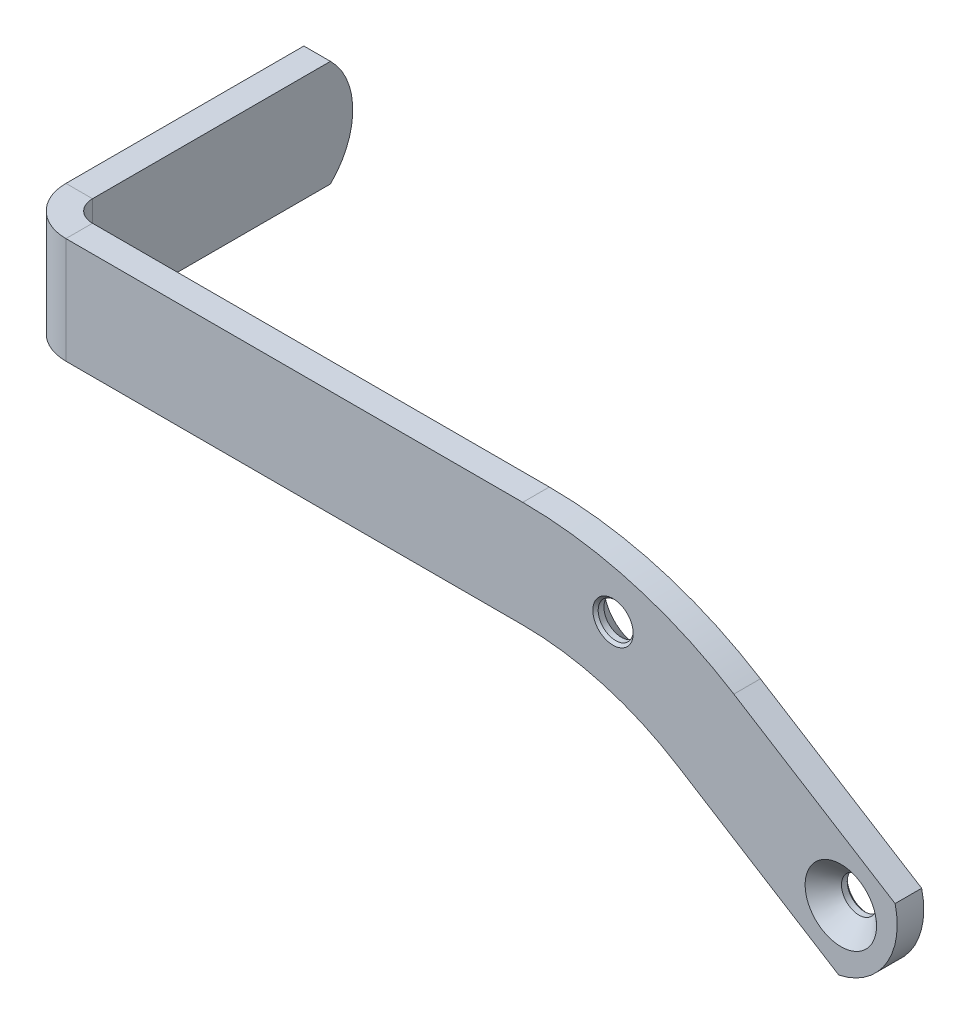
ISO-10303-21;
HEADER;
FILE_DESCRIPTION(('STEP AP214'),'2;1');
FILE_NAME('part.step','',(''),(''),'','','');
FILE_SCHEMA(('AUTOMOTIVE_DESIGN { 1 0 10303 214 1 1 1 1 }'));
ENDSEC;
DATA;
#1=APPLICATION_CONTEXT('core data for automotive mechanical design processes');
#2=APPLICATION_PROTOCOL_DEFINITION('international standard','automotive_design',2000,#1);
#3=PRODUCT_CONTEXT('',#1,'mechanical');
#4=PRODUCT('Part','Part','',(#3));
#5=PRODUCT_RELATED_PRODUCT_CATEGORY('part','',(#4));
#6=PRODUCT_DEFINITION_FORMATION('','',#4);
#7=PRODUCT_DEFINITION_CONTEXT('part definition',#1,'design');
#8=PRODUCT_DEFINITION('design','',#6,#7);
#9=PRODUCT_DEFINITION_SHAPE('','',#8);
#10=(LENGTH_UNIT() NAMED_UNIT(*) SI_UNIT(.MILLI.,.METRE.));
#11=(NAMED_UNIT(*) PLANE_ANGLE_UNIT() SI_UNIT($,.RADIAN.));
#12=(NAMED_UNIT(*) SI_UNIT($,.STERADIAN.) SOLID_ANGLE_UNIT());
#13=UNCERTAINTY_MEASURE_WITH_UNIT(LENGTH_MEASURE(1.E-05),#10,'distance_accuracy_value','');
#14=(GEOMETRIC_REPRESENTATION_CONTEXT(3) GLOBAL_UNCERTAINTY_ASSIGNED_CONTEXT((#13)) GLOBAL_UNIT_ASSIGNED_CONTEXT((#10,
#11,#12)) REPRESENTATION_CONTEXT('',''));
#15=CARTESIAN_POINT('',(0.,0.,0.));
#16=DIRECTION('',(0.,0.,1.));
#17=DIRECTION('',(1.,0.,0.));
#18=AXIS2_PLACEMENT_3D('',#15,#16,#17);
#19=CARTESIAN_POINT('',(-4.99999999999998,0.,0.));
#20=DIRECTION('',(-1.,0.,0.));
#21=DIRECTION('',(0.,0.,1.));
#22=AXIS2_PLACEMENT_3D('',#19,#20,#21);
#23=PLANE('',#22);
#24=CARTESIAN_POINT('',(-4.99999999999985,0.,-43.9999999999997));
#25=DIRECTION('',(-1.,0.,0.));
#26=DIRECTION('',(0.,0.,1.));
#27=AXIS2_PLACEMENT_3D('',#24,#25,#26);
#28=CIRCLE('',#27,14.);
#29=CARTESIAN_POINT('',(-5.00000000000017,10.,-53.7979589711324));
#30=VERTEX_POINT('',#29);
#31=CARTESIAN_POINT('',(-5.00000000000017,-9.99999999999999,-53.7979589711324));
#32=VERTEX_POINT('',#31);
#33=EDGE_CURVE('E129',#30,#32,#28,.T.);
#34=ORIENTED_EDGE('',*,*,#33,.T.);
#35=DIRECTION('',(0.,0.,-1.));
#36=VECTOR('',#35,1.);
#37=CARTESIAN_POINT('',(-5.00000000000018,-9.99999999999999,-57.9999999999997));
#38=LINE('',#37,#36);
#39=CARTESIAN_POINT('',(-5.00000000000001,-10.,-8.99999999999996));
#40=VERTEX_POINT('',#39);
#41=EDGE_CURVE('E133',#40,#32,#38,.T.);
#42=ORIENTED_EDGE('',*,*,#41,.F.);
#43=DIRECTION('',(0.,1.,0.));
#44=VECTOR('',#43,1.);
#45=CARTESIAN_POINT('',(-5.00000000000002,0.,-8.99999999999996));
#46=LINE('',#45,#44);
#47=CARTESIAN_POINT('',(-5.00000000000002,10.,-8.99999999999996));
#48=VERTEX_POINT('',#47);
#49=EDGE_CURVE('E159',#40,#48,#46,.T.);
#50=ORIENTED_EDGE('',*,*,#49,.T.);
#51=DIRECTION('',(0.,0.,1.));
#52=VECTOR('',#51,1.);
#53=CARTESIAN_POINT('',(-5.,10.,-4.99999999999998));
#54=LINE('',#53,#52);
#55=EDGE_CURVE('E134',#30,#48,#54,.T.);
#56=ORIENTED_EDGE('',*,*,#55,.F.);
#57=EDGE_LOOP('',(#34,#42,#50,#56));
#58=FACE_BOUND('',#57,.T.);
#59=ADVANCED_FACE('F39',(#58),#23,.T.);
#60=CARTESIAN_POINT('',(0.,0.,0.));
#61=DIRECTION('',(-1.,0.,0.));
#62=DIRECTION('',(0.,0.,1.));
#63=AXIS2_PLACEMENT_3D('',#60,#61,#62);
#64=PLANE('',#63);
#65=DIRECTION('',(0.,0.,-1.));
#66=VECTOR('',#65,1.);
#67=CARTESIAN_POINT('',(-1.85048510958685E-13,-9.99999999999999,-57.9999999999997));
#68=LINE('',#67,#66);
#69=CARTESIAN_POINT('',(0.,-10.,-8.99999999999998));
#70=VERTEX_POINT('',#69);
#71=CARTESIAN_POINT('',(-1.70487335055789E-13,-9.99999999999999,-53.7979589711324));
#72=VERTEX_POINT('',#71);
#73=EDGE_CURVE('E156',#70,#72,#68,.T.);
#74=ORIENTED_EDGE('',*,*,#73,.T.);
#75=CARTESIAN_POINT('',(1.53625178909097E-13,0.,-43.9999999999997));
#76=DIRECTION('',(-1.,0.,0.));
#77=DIRECTION('',(0.,0.,1.));
#78=AXIS2_PLACEMENT_3D('',#75,#76,#77);
#79=CIRCLE('',#78,14.);
#80=CARTESIAN_POINT('',(-1.73846610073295E-13,10.,-53.7979589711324));
#81=VERTEX_POINT('',#80);
#82=EDGE_CURVE('E138',#81,#72,#79,.T.);
#83=ORIENTED_EDGE('',*,*,#82,.F.);
#84=DIRECTION('',(0.,0.,1.));
#85=VECTOR('',#84,1.);
#86=CARTESIAN_POINT('',(0.,10.,-5.));
#87=LINE('',#86,#85);
#88=CARTESIAN_POINT('',(0.,10.,-8.99999999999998));
#89=VERTEX_POINT('',#88);
#90=EDGE_CURVE('E152',#81,#89,#87,.T.);
#91=ORIENTED_EDGE('',*,*,#90,.T.);
#92=DIRECTION('',(0.,1.,0.));
#93=VECTOR('',#92,1.);
#94=CARTESIAN_POINT('',(0.,-9.99999999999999,-8.99999999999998));
#95=LINE('',#94,#93);
#96=EDGE_CURVE('E347',#70,#89,#95,.T.);
#97=ORIENTED_EDGE('',*,*,#96,.F.);
#98=EDGE_LOOP('',(#74,#83,#91,#97));
#99=FACE_BOUND('',#98,.T.);
#100=ADVANCED_FACE('F246',(#99),#64,.F.);
#101=CARTESIAN_POINT('',(-5.00000000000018,-9.99999999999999,-57.9999999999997));
#102=DIRECTION('',(0.,-1.,0.));
#103=DIRECTION('',(1.,0.,0.));
#104=AXIS2_PLACEMENT_3D('',#101,#102,#103);
#105=PLANE('',#104);
#106=ORIENTED_EDGE('',*,*,#41,.T.);
#107=DIRECTION('',(-1.,0.,0.));
#108=VECTOR('',#107,1.);
#109=CARTESIAN_POINT('',(-5.00000000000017,-9.99999999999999,-53.7979589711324));
#110=LINE('',#109,#108);
#111=EDGE_CURVE('E141',#32,#72,#110,.F.);
#112=ORIENTED_EDGE('',*,*,#111,.T.);
#113=ORIENTED_EDGE('',*,*,#73,.F.);
#114=DIRECTION('',(-1.,0.,0.));
#115=VECTOR('',#114,1.);
#116=CARTESIAN_POINT('',(0.,-9.99999999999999,-8.99999999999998));
#117=LINE('',#116,#115);
#118=EDGE_CURVE('E151',#70,#40,#117,.T.);
#119=ORIENTED_EDGE('',*,*,#118,.T.);
#120=EDGE_LOOP('',(#106,#112,#113,#119));
#121=FACE_BOUND('',#120,.T.);
#122=ADVANCED_FACE('F150',(#121),#105,.T.);
#123=CARTESIAN_POINT('',(-5.,10.,-4.99999999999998));
#124=DIRECTION('',(0.,1.,0.));
#125=DIRECTION('',(-1.,0.,0.));
#126=AXIS2_PLACEMENT_3D('',#123,#124,#125);
#127=PLANE('',#126);
#128=ORIENTED_EDGE('',*,*,#90,.F.);
#129=DIRECTION('',(1.,0.,0.));
#130=VECTOR('',#129,1.);
#131=CARTESIAN_POINT('',(-1.73846610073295E-13,10.,-53.7979589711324));
#132=LINE('',#131,#130);
#133=EDGE_CURVE('E137',#81,#30,#132,.F.);
#134=ORIENTED_EDGE('',*,*,#133,.T.);
#135=ORIENTED_EDGE('',*,*,#55,.T.);
#136=DIRECTION('',(-1.,0.,0.));
#137=VECTOR('',#136,1.);
#138=CARTESIAN_POINT('',(0.,10.,-8.99999999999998));
#139=LINE('',#138,#137);
#140=EDGE_CURVE('E350',#89,#48,#139,.T.);
#141=ORIENTED_EDGE('',*,*,#140,.F.);
#142=EDGE_LOOP('',(#128,#134,#135,#141));
#143=FACE_BOUND('',#142,.T.);
#144=ADVANCED_FACE('F257',(#143),#127,.T.);
#145=CARTESIAN_POINT('',(90.,-65.,-5.));
#146=DIRECTION('',(0.,0.,-1.));
#147=DIRECTION('',(-1.,0.,0.));
#148=AXIS2_PLACEMENT_3D('',#145,#146,#147);
#149=PLANE('',#148);
#150=CARTESIAN_POINT('',(107.,-0.999999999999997,-5.));
#151=DIRECTION('',(0.,0.,-1.));
#152=DIRECTION('',(-1.,0.,0.));
#153=AXIS2_PLACEMENT_3D('',#150,#151,#152);
#154=CIRCLE('',#153,6.72);
#155=CARTESIAN_POINT('',(100.28,-0.999999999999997,-5.));
#156=VERTEX_POINT('',#155);
#157=EDGE_CURVE('E559',#156,#156,#154,.T.);
#158=ORIENTED_EDGE('',*,*,#157,.F.);
#159=EDGE_LOOP('',(#158));
#160=FACE_BOUND('',#159,.T.);
#161=CARTESIAN_POINT('',(149.886195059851,-25.7744516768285,-5.));
#162=DIRECTION('',(0.,0.,-1.));
#163=DIRECTION('',(-1.,0.,0.));
#164=AXIS2_PLACEMENT_3D('',#161,#162,#163);
#165=CIRCLE('',#164,3.80000000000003);
#166=CARTESIAN_POINT('',(146.086195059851,-25.7744516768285,-5.));
#167=VERTEX_POINT('',#166);
#168=EDGE_CURVE('E227',#167,#167,#165,.F.);
#169=ORIENTED_EDGE('',*,*,#168,.T.);
#170=EDGE_LOOP('',(#169));
#171=FACE_BOUND('',#170,.T.);
#172=DIRECTION('',(-0.848048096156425,0.529919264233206,0.));
#173=VECTOR('',#172,1.);
#174=CARTESIAN_POINT('',(129.74394481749,-1.39639278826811,-5.));
#175=LINE('',#174,#173);
#176=CARTESIAN_POINT('',(160.102335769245,-20.3664208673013,-5.));
#177=VERTEX_POINT('',#176);
#178=CARTESIAN_POINT('',(129.74394481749,-1.3963927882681,-5.));
#179=VERTEX_POINT('',#178);
#180=EDGE_CURVE('E192',#177,#179,#175,.T.);
#181=ORIENTED_EDGE('',*,*,#180,.F.);
#182=CARTESIAN_POINT('',(146.494002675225,-23.6547746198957,-5.));
#183=DIRECTION('',(0.,0.,-1.));
#184=DIRECTION('',(-1.,0.,0.));
#185=AXIS2_PLACEMENT_3D('',#182,#183,#184);
#186=CIRCLE('',#185,14.);
#187=CARTESIAN_POINT('',(149.503950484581,-37.3273827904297,-5.));
#188=VERTEX_POINT('',#187);
#189=EDGE_CURVE('E341',#177,#188,#186,.T.);
#190=ORIENTED_EDGE('',*,*,#189,.T.);
#191=DIRECTION('',(0.848048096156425,-0.529919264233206,0.));
#192=VECTOR('',#191,1.);
#193=CARTESIAN_POINT('',(153.067483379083,-39.5541252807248,-5.));
#194=LINE('',#193,#192);
#195=CARTESIAN_POINT('',(119.145559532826,-18.3573547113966,-5.));
#196=VERTEX_POINT('',#195);
#197=EDGE_CURVE('E189',#196,#188,#194,.T.);
#198=ORIENTED_EDGE('',*,*,#197,.F.);
#199=CARTESIAN_POINT('',(90.,-65.,-5.));
#200=DIRECTION('',(0.,0.,-1.));
#201=DIRECTION('',(1.,0.,0.));
#202=AXIS2_PLACEMENT_3D('',#199,#200,#201);
#203=CIRCLE('',#202,55.);
#204=CARTESIAN_POINT('',(90.,-9.99999999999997,-5.));
#205=VERTEX_POINT('',#204);
#206=EDGE_CURVE('E185',#205,#196,#203,.T.);
#207=ORIENTED_EDGE('',*,*,#206,.F.);
#208=DIRECTION('',(1.,0.,0.));
#209=VECTOR('',#208,1.);
#210=CARTESIAN_POINT('',(90.,-9.99999999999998,-5.));
#211=LINE('',#210,#209);
#212=CARTESIAN_POINT('',(4.,-10.,-5.));
#213=VERTEX_POINT('',#212);
#214=EDGE_CURVE('E183',#213,#205,#211,.T.);
#215=ORIENTED_EDGE('',*,*,#214,.F.);
#216=DIRECTION('',(0.,1.,0.));
#217=VECTOR('',#216,1.);
#218=CARTESIAN_POINT('',(3.99999999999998,10.,-5.));
#219=LINE('',#218,#217);
#220=CARTESIAN_POINT('',(3.99999999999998,10.,-5.));
#221=VERTEX_POINT('',#220);
#222=EDGE_CURVE('E175',#221,#213,#219,.F.);
#223=ORIENTED_EDGE('',*,*,#222,.F.);
#224=DIRECTION('',(-1.,0.,0.));
#225=VECTOR('',#224,1.);
#226=CARTESIAN_POINT('',(0.,10.,-5.));
#227=LINE('',#226,#225);
#228=CARTESIAN_POINT('',(90.,10.,-5.));
#229=VERTEX_POINT('',#228);
#230=EDGE_CURVE('E197',#229,#221,#227,.T.);
#231=ORIENTED_EDGE('',*,*,#230,.F.);
#232=CARTESIAN_POINT('',(90.,-65.,-5.));
#233=DIRECTION('',(0.,0.,1.));
#234=DIRECTION('',(-1.,0.,0.));
#235=AXIS2_PLACEMENT_3D('',#232,#233,#234);
#236=CIRCLE('',#235,75.);
#237=EDGE_CURVE('E194',#179,#229,#236,.T.);
#238=ORIENTED_EDGE('',*,*,#237,.F.);
#239=EDGE_LOOP('',(#181,#190,#198,#207,#215,#223,#231,#238));
#240=FACE_BOUND('',#239,.T.);
#241=ADVANCED_FACE('F260',(#160,#171,#240),#149,.T.);
#242=CARTESIAN_POINT('',(90.,-65.,0.));
#243=DIRECTION('',(0.,0.,-1.));
#244=DIRECTION('',(-1.,0.,0.));
#245=AXIS2_PLACEMENT_3D('',#242,#243,#244);
#246=PLANE('',#245);
#247=CARTESIAN_POINT('',(107.,-0.999999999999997,0.));
#248=DIRECTION('',(0.,0.,-1.));
#249=DIRECTION('',(-1.,0.,0.));
#250=AXIS2_PLACEMENT_3D('',#247,#248,#249);
#251=CIRCLE('',#250,3.79999999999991);
#252=CARTESIAN_POINT('',(103.2,-0.999999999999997,0.));
#253=VERTEX_POINT('',#252);
#254=EDGE_CURVE('E47',#253,#253,#251,.T.);
#255=ORIENTED_EDGE('',*,*,#254,.T.);
#256=EDGE_LOOP('',(#255));
#257=FACE_BOUND('',#256,.T.);
#258=CARTESIAN_POINT('',(149.886195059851,-25.7744516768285,0.));
#259=DIRECTION('',(0.,0.,1.));
#260=DIRECTION('',(1.,0.,0.));
#261=AXIS2_PLACEMENT_3D('',#258,#259,#260);
#262=CIRCLE('',#261,6.72);
#263=CARTESIAN_POINT('',(156.606195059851,-25.7744516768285,0.));
#264=VERTEX_POINT('',#263);
#265=EDGE_CURVE('E329',#264,#264,#262,.T.);
#266=ORIENTED_EDGE('',*,*,#265,.F.);
#267=EDGE_LOOP('',(#266));
#268=FACE_BOUND('',#267,.T.);
#269=CARTESIAN_POINT('',(146.494002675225,-23.6547746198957,0.));
#270=DIRECTION('',(0.,0.,-1.));
#271=DIRECTION('',(-1.,0.,0.));
#272=AXIS2_PLACEMENT_3D('',#269,#270,#271);
#273=CIRCLE('',#272,14.);
#274=CARTESIAN_POINT('',(160.102335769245,-20.3664208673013,0.));
#275=VERTEX_POINT('',#274);
#276=CARTESIAN_POINT('',(149.503950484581,-37.3273827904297,0.));
#277=VERTEX_POINT('',#276);
#278=EDGE_CURVE('E54',#275,#277,#273,.T.);
#279=ORIENTED_EDGE('',*,*,#278,.F.);
#280=DIRECTION('',(-0.848048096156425,0.529919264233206,0.));
#281=VECTOR('',#280,1.);
#282=CARTESIAN_POINT('',(129.74394481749,-1.39639278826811,0.));
#283=LINE('',#282,#281);
#284=CARTESIAN_POINT('',(129.74394481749,-1.3963927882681,0.));
#285=VERTEX_POINT('',#284);
#286=EDGE_CURVE('E208',#275,#285,#283,.T.);
#287=ORIENTED_EDGE('',*,*,#286,.T.);
#288=CARTESIAN_POINT('',(90.,-65.,0.));
#289=DIRECTION('',(0.,0.,1.));
#290=DIRECTION('',(-1.,0.,0.));
#291=AXIS2_PLACEMENT_3D('',#288,#289,#290);
#292=CIRCLE('',#291,75.);
#293=CARTESIAN_POINT('',(90.,10.,0.));
#294=VERTEX_POINT('',#293);
#295=EDGE_CURVE('E210',#285,#294,#292,.T.);
#296=ORIENTED_EDGE('',*,*,#295,.T.);
#297=DIRECTION('',(-1.,0.,0.));
#298=VECTOR('',#297,1.);
#299=CARTESIAN_POINT('',(0.,10.,0.));
#300=LINE('',#299,#298);
#301=CARTESIAN_POINT('',(3.99999999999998,10.,0.));
#302=VERTEX_POINT('',#301);
#303=EDGE_CURVE('E186',#294,#302,#300,.T.);
#304=ORIENTED_EDGE('',*,*,#303,.T.);
#305=DIRECTION('',(0.,1.,0.));
#306=VECTOR('',#305,1.);
#307=CARTESIAN_POINT('',(3.99999999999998,10.,0.));
#308=LINE('',#307,#306);
#309=CARTESIAN_POINT('',(4.,-10.,0.));
#310=VERTEX_POINT('',#309);
#311=EDGE_CURVE('E163',#302,#310,#308,.F.);
#312=ORIENTED_EDGE('',*,*,#311,.T.);
#313=DIRECTION('',(1.,0.,0.));
#314=VECTOR('',#313,1.);
#315=CARTESIAN_POINT('',(90.,-9.99999999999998,0.));
#316=LINE('',#315,#314);
#317=CARTESIAN_POINT('',(90.,-9.99999999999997,0.));
#318=VERTEX_POINT('',#317);
#319=EDGE_CURVE('E181',#310,#318,#316,.T.);
#320=ORIENTED_EDGE('',*,*,#319,.T.);
#321=CARTESIAN_POINT('',(90.,-65.,0.));
#322=DIRECTION('',(0.,0.,-1.));
#323=DIRECTION('',(1.,0.,0.));
#324=AXIS2_PLACEMENT_3D('',#321,#322,#323);
#325=CIRCLE('',#324,55.);
#326=CARTESIAN_POINT('',(119.145559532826,-18.3573547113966,0.));
#327=VERTEX_POINT('',#326);
#328=EDGE_CURVE('E202',#318,#327,#325,.T.);
#329=ORIENTED_EDGE('',*,*,#328,.T.);
#330=DIRECTION('',(0.848048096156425,-0.529919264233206,0.));
#331=VECTOR('',#330,1.);
#332=CARTESIAN_POINT('',(153.067483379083,-39.5541252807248,0.));
#333=LINE('',#332,#331);
#334=EDGE_CURVE('E205',#327,#277,#333,.T.);
#335=ORIENTED_EDGE('',*,*,#334,.T.);
#336=EDGE_LOOP('',(#279,#287,#296,#304,#312,#320,#329,#335));
#337=FACE_BOUND('',#336,.T.);
#338=ADVANCED_FACE('F232',(#257,#268,#337),#246,.F.);
#339=CARTESIAN_POINT('',(129.74394481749,-1.39639278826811,-5.));
#340=DIRECTION('',(0.529919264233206,0.848048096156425,0.));
#341=DIRECTION('',(-0.848048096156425,0.529919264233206,0.));
#342=AXIS2_PLACEMENT_3D('',#339,#340,#341);
#343=PLANE('',#342);
#344=ORIENTED_EDGE('',*,*,#286,.F.);
#345=DIRECTION('',(0.,0.,1.));
#346=VECTOR('',#345,1.);
#347=CARTESIAN_POINT('',(160.102335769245,-20.3664208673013,0.));
#348=LINE('',#347,#346);
#349=EDGE_CURVE('E338',#275,#177,#348,.F.);
#350=ORIENTED_EDGE('',*,*,#349,.T.);
#351=ORIENTED_EDGE('',*,*,#180,.T.);
#352=DIRECTION('',(0.,0.,1.));
#353=VECTOR('',#352,1.);
#354=CARTESIAN_POINT('',(129.74394481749,-1.3963927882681,-5.));
#355=LINE('',#354,#353);
#356=EDGE_CURVE('E218',#179,#285,#355,.T.);
#357=ORIENTED_EDGE('',*,*,#356,.T.);
#358=EDGE_LOOP('',(#344,#350,#351,#357));
#359=FACE_BOUND('',#358,.T.);
#360=ADVANCED_FACE('F286',(#359),#343,.T.);
#361=CARTESIAN_POINT('',(153.067483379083,-39.5541252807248,-5.));
#362=DIRECTION('',(-0.529919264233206,-0.848048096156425,0.));
#363=DIRECTION('',(0.848048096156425,-0.529919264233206,0.));
#364=AXIS2_PLACEMENT_3D('',#361,#362,#363);
#365=PLANE('',#364);
#366=ORIENTED_EDGE('',*,*,#197,.T.);
#367=DIRECTION('',(0.,0.,-1.));
#368=VECTOR('',#367,1.);
#369=CARTESIAN_POINT('',(149.503950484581,-37.3273827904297,-5.));
#370=LINE('',#369,#368);
#371=EDGE_CURVE('E343',#188,#277,#370,.F.);
#372=ORIENTED_EDGE('',*,*,#371,.T.);
#373=ORIENTED_EDGE('',*,*,#334,.F.);
#374=DIRECTION('',(0.,0.,1.));
#375=VECTOR('',#374,1.);
#376=CARTESIAN_POINT('',(119.145559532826,-18.3573547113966,-5.));
#377=LINE('',#376,#375);
#378=EDGE_CURVE('E221',#196,#327,#377,.T.);
#379=ORIENTED_EDGE('',*,*,#378,.F.);
#380=EDGE_LOOP('',(#366,#372,#373,#379));
#381=FACE_BOUND('',#380,.T.);
#382=ADVANCED_FACE('F291',(#381),#365,.T.);
#383=CARTESIAN_POINT('',(0.,10.,-5.));
#384=DIRECTION('',(0.,1.,0.));
#385=DIRECTION('',(0.,0.,1.));
#386=AXIS2_PLACEMENT_3D('',#383,#384,#385);
#387=PLANE('',#386);
#388=ORIENTED_EDGE('',*,*,#230,.T.);
#389=DIRECTION('',(0.,0.,1.));
#390=VECTOR('',#389,1.);
#391=CARTESIAN_POINT('',(3.99999999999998,10.,-5.));
#392=LINE('',#391,#390);
#393=EDGE_CURVE('E169',#221,#302,#392,.T.);
#394=ORIENTED_EDGE('',*,*,#393,.T.);
#395=ORIENTED_EDGE('',*,*,#303,.F.);
#396=DIRECTION('',(0.,0.,1.));
#397=VECTOR('',#396,1.);
#398=CARTESIAN_POINT('',(90.,10.,-5.));
#399=LINE('',#398,#397);
#400=EDGE_CURVE('E215',#229,#294,#399,.T.);
#401=ORIENTED_EDGE('',*,*,#400,.F.);
#402=EDGE_LOOP('',(#388,#394,#395,#401));
#403=FACE_BOUND('',#402,.T.);
#404=ADVANCED_FACE('F287',(#403),#387,.T.);
#405=CARTESIAN_POINT('',(90.,-65.,-5.));
#406=DIRECTION('',(0.,0.,1.));
#407=DIRECTION('',(1.,0.,0.));
#408=AXIS2_PLACEMENT_3D('',#405,#406,#407);
#409=CYLINDRICAL_SURFACE('',#408,75.);
#410=ORIENTED_EDGE('',*,*,#295,.F.);
#411=ORIENTED_EDGE('',*,*,#356,.F.);
#412=ORIENTED_EDGE('',*,*,#237,.T.);
#413=ORIENTED_EDGE('',*,*,#400,.T.);
#414=EDGE_LOOP('',(#410,#411,#412,#413));
#415=FACE_BOUND('',#414,.T.);
#416=ADVANCED_FACE('F290',(#415),#409,.T.);
#417=CARTESIAN_POINT('',(90.,-65.,-5.));
#418=DIRECTION('',(0.,0.,1.));
#419=DIRECTION('',(1.,0.,0.));
#420=AXIS2_PLACEMENT_3D('',#417,#418,#419);
#421=CYLINDRICAL_SURFACE('',#420,55.);
#422=ORIENTED_EDGE('',*,*,#328,.F.);
#423=DIRECTION('',(0.,0.,1.));
#424=VECTOR('',#423,1.);
#425=CARTESIAN_POINT('',(90.,-9.99999999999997,-5.));
#426=LINE('',#425,#424);
#427=EDGE_CURVE('E200',#205,#318,#426,.T.);
#428=ORIENTED_EDGE('',*,*,#427,.F.);
#429=ORIENTED_EDGE('',*,*,#206,.T.);
#430=ORIENTED_EDGE('',*,*,#378,.T.);
#431=EDGE_LOOP('',(#422,#428,#429,#430));
#432=FACE_BOUND('',#431,.T.);
#433=ADVANCED_FACE('F295',(#432),#421,.F.);
#434=CARTESIAN_POINT('',(90.,-9.99999999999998,-5.));
#435=DIRECTION('',(0.,-1.,0.));
#436=DIRECTION('',(1.,0.,0.));
#437=AXIS2_PLACEMENT_3D('',#434,#435,#436);
#438=PLANE('',#437);
#439=DIRECTION('',(0.,0.,1.));
#440=VECTOR('',#439,1.);
#441=CARTESIAN_POINT('',(3.99999999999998,-10.,-5.));
#442=LINE('',#441,#440);
#443=EDGE_CURVE('E62',#213,#310,#442,.T.);
#444=ORIENTED_EDGE('',*,*,#443,.F.);
#445=ORIENTED_EDGE('',*,*,#214,.T.);
#446=ORIENTED_EDGE('',*,*,#427,.T.);
#447=ORIENTED_EDGE('',*,*,#319,.F.);
#448=EDGE_LOOP('',(#444,#445,#446,#447));
#449=FACE_BOUND('',#448,.T.);
#450=ADVANCED_FACE('F276',(#449),#438,.T.);
#451=CARTESIAN_POINT('',(3.99999999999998,-10.,-8.99999999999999));
#452=DIRECTION('',(0.,-1.,0.));
#453=DIRECTION('',(1.,0.,0.));
#454=AXIS2_PLACEMENT_3D('',#451,#452,#453);
#455=PLANE('',#454);
#456=ORIENTED_EDGE('',*,*,#118,.F.);
#457=CARTESIAN_POINT('',(3.99999999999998,-10.,-8.99999999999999));
#458=DIRECTION('',(0.,1.,0.));
#459=DIRECTION('',(-1.,0.,0.));
#460=AXIS2_PLACEMENT_3D('',#457,#458,#459);
#461=CIRCLE('',#460,3.99999999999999);
#462=EDGE_CURVE('E172',#213,#70,#461,.F.);
#463=ORIENTED_EDGE('',*,*,#462,.F.);
#464=ORIENTED_EDGE('',*,*,#443,.T.);
#465=CARTESIAN_POINT('',(3.99999999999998,-10.,-8.99999999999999));
#466=DIRECTION('',(0.,1.,0.));
#467=DIRECTION('',(-1.,0.,0.));
#468=AXIS2_PLACEMENT_3D('',#465,#466,#467);
#469=CIRCLE('',#468,8.99999999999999);
#470=EDGE_CURVE('E165',#310,#40,#469,.F.);
#471=ORIENTED_EDGE('',*,*,#470,.T.);
#472=EDGE_LOOP('',(#456,#463,#464,#471));
#473=FACE_BOUND('',#472,.T.);
#474=ADVANCED_FACE('F273',(#473),#455,.T.);
#475=CARTESIAN_POINT('',(3.99999999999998,10.,-8.99999999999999));
#476=DIRECTION('',(0.,-1.,0.));
#477=DIRECTION('',(1.,0.,0.));
#478=AXIS2_PLACEMENT_3D('',#475,#476,#477);
#479=PLANE('',#478);
#480=CARTESIAN_POINT('',(3.99999999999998,10.,-8.99999999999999));
#481=DIRECTION('',(0.,1.,0.));
#482=DIRECTION('',(-1.,0.,0.));
#483=AXIS2_PLACEMENT_3D('',#480,#481,#482);
#484=CIRCLE('',#483,3.99999999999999);
#485=EDGE_CURVE('E154',#89,#221,#484,.T.);
#486=ORIENTED_EDGE('',*,*,#485,.F.);
#487=ORIENTED_EDGE('',*,*,#140,.T.);
#488=CARTESIAN_POINT('',(3.99999999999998,10.,-8.99999999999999));
#489=DIRECTION('',(0.,1.,0.));
#490=DIRECTION('',(-1.,0.,0.));
#491=AXIS2_PLACEMENT_3D('',#488,#489,#490);
#492=CIRCLE('',#491,8.99999999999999);
#493=EDGE_CURVE('E166',#48,#302,#492,.T.);
#494=ORIENTED_EDGE('',*,*,#493,.T.);
#495=ORIENTED_EDGE('',*,*,#393,.F.);
#496=EDGE_LOOP('',(#486,#487,#494,#495));
#497=FACE_BOUND('',#496,.T.);
#498=ADVANCED_FACE('F268',(#497),#479,.F.);
#499=CARTESIAN_POINT('',(3.99999999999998,10.,-8.99999999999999));
#500=DIRECTION('',(0.,1.,0.));
#501=DIRECTION('',(-1.,0.,0.));
#502=AXIS2_PLACEMENT_3D('',#499,#500,#501);
#503=CYLINDRICAL_SURFACE('',#502,8.99999999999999);
#504=ORIENTED_EDGE('',*,*,#311,.F.);
#505=ORIENTED_EDGE('',*,*,#493,.F.);
#506=ORIENTED_EDGE('',*,*,#49,.F.);
#507=ORIENTED_EDGE('',*,*,#470,.F.);
#508=EDGE_LOOP('',(#504,#505,#506,#507));
#509=FACE_BOUND('',#508,.T.);
#510=ADVANCED_FACE('F264',(#509),#503,.T.);
#511=CARTESIAN_POINT('',(3.99999999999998,10.,-8.99999999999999));
#512=DIRECTION('',(0.,1.,0.));
#513=DIRECTION('',(-1.,0.,0.));
#514=AXIS2_PLACEMENT_3D('',#511,#512,#513);
#515=CYLINDRICAL_SURFACE('',#514,3.99999999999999);
#516=ORIENTED_EDGE('',*,*,#222,.T.);
#517=ORIENTED_EDGE('',*,*,#462,.T.);
#518=ORIENTED_EDGE('',*,*,#96,.T.);
#519=ORIENTED_EDGE('',*,*,#485,.T.);
#520=EDGE_LOOP('',(#516,#517,#518,#519));
#521=FACE_BOUND('',#520,.T.);
#522=ADVANCED_FACE('F267',(#521),#515,.F.);
#523=CARTESIAN_POINT('',(146.494002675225,-23.6547746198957,-5.));
#524=DIRECTION('',(0.,0.,-1.));
#525=DIRECTION('',(-1.,0.,0.));
#526=AXIS2_PLACEMENT_3D('',#523,#524,#525);
#527=CYLINDRICAL_SURFACE('',#526,14.);
#528=ORIENTED_EDGE('',*,*,#371,.F.);
#529=ORIENTED_EDGE('',*,*,#189,.F.);
#530=ORIENTED_EDGE('',*,*,#349,.F.);
#531=ORIENTED_EDGE('',*,*,#278,.T.);
#532=EDGE_LOOP('',(#528,#529,#530,#531));
#533=FACE_BOUND('',#532,.T.);
#534=ADVANCED_FACE('F254',(#533),#527,.T.);
#535=CARTESIAN_POINT('',(1.53625178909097E-13,0.,-43.9999999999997));
#536=DIRECTION('',(-1.,0.,0.));
#537=DIRECTION('',(0.,0.,1.));
#538=AXIS2_PLACEMENT_3D('',#535,#536,#537);
#539=CYLINDRICAL_SURFACE('',#538,14.);
#540=ORIENTED_EDGE('',*,*,#82,.T.);
#541=ORIENTED_EDGE('',*,*,#111,.F.);
#542=ORIENTED_EDGE('',*,*,#33,.F.);
#543=ORIENTED_EDGE('',*,*,#133,.F.);
#544=EDGE_LOOP('',(#540,#541,#542,#543));
#545=FACE_BOUND('',#544,.T.);
#546=ADVANCED_FACE('F142',(#545),#539,.T.);
#547=CARTESIAN_POINT('',(149.886195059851,-25.7744516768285,0.));
#548=DIRECTION('',(0.,0.,1.));
#549=DIRECTION('',(1.,0.,0.));
#550=AXIS2_PLACEMENT_3D('',#547,#548,#549);
#551=CYLINDRICAL_SURFACE('',#550,3.3);
#552=CARTESIAN_POINT('',(149.886195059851,-25.7744516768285,-4.49999999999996));
#553=DIRECTION('',(0.,0.,-1.));
#554=DIRECTION('',(-1.,0.,0.));
#555=AXIS2_PLACEMENT_3D('',#552,#553,#554);
#556=CIRCLE('',#555,3.3);
#557=CARTESIAN_POINT('',(146.586195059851,-25.7744516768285,-4.49999999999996));
#558=VERTEX_POINT('',#557);
#559=EDGE_CURVE('E217',#558,#558,#556,.T.);
#560=ORIENTED_EDGE('',*,*,#559,.T.);
#561=EDGE_LOOP('',(#560));
#562=FACE_BOUND('',#561,.T.);
#563=CARTESIAN_POINT('',(149.886195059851,-25.7744516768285,-3.42000000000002));
#564=DIRECTION('',(0.,0.,1.));
#565=DIRECTION('',(1.,0.,0.));
#566=AXIS2_PLACEMENT_3D('',#563,#564,#565);
#567=CIRCLE('',#566,3.3);
#568=CARTESIAN_POINT('',(153.186195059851,-25.7744516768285,-3.42000000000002));
#569=VERTEX_POINT('',#568);
#570=EDGE_CURVE('E147',#569,#569,#567,.T.);
#571=ORIENTED_EDGE('',*,*,#570,.T.);
#572=EDGE_LOOP('',(#571));
#573=FACE_BOUND('',#572,.T.);
#574=ADVANCED_FACE('F317',(#562,#573),#551,.F.);
#575=CARTESIAN_POINT('',(149.886195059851,-25.7744516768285,0.));
#576=DIRECTION('',(0.,0.,1.));
#577=DIRECTION('',(1.,0.,0.));
#578=AXIS2_PLACEMENT_3D('',#575,#576,#577);
#579=CONICAL_SURFACE('',#578,6.72,0.785398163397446);
#580=ORIENTED_EDGE('',*,*,#570,.F.);
#581=EDGE_LOOP('',(#580));
#582=FACE_BOUND('',#581,.T.);
#583=ORIENTED_EDGE('',*,*,#265,.T.);
#584=EDGE_LOOP('',(#583));
#585=FACE_BOUND('',#584,.T.);
#586=ADVANCED_FACE('F309',(#582,#585),#579,.F.);
#587=CARTESIAN_POINT('',(149.886195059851,-25.7744516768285,-4.49999999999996));
#588=DIRECTION('',(0.,0.,-1.));
#589=DIRECTION('',(-1.,0.,0.));
#590=AXIS2_PLACEMENT_3D('',#587,#588,#589);
#591=CONICAL_SURFACE('',#590,3.3,0.785398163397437);
#592=ORIENTED_EDGE('',*,*,#168,.F.);
#593=EDGE_LOOP('',(#592));
#594=FACE_BOUND('',#593,.T.);
#595=ORIENTED_EDGE('',*,*,#559,.F.);
#596=EDGE_LOOP('',(#595));
#597=FACE_BOUND('',#596,.T.);
#598=ADVANCED_FACE('F307',(#594,#597),#591,.F.);
#599=CARTESIAN_POINT('',(107.,-0.999999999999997,-5.));
#600=DIRECTION('',(0.,0.,-1.));
#601=DIRECTION('',(-1.,0.,0.));
#602=AXIS2_PLACEMENT_3D('',#599,#600,#601);
#603=CYLINDRICAL_SURFACE('',#602,3.29999999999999);
#604=CARTESIAN_POINT('',(107.,-0.999999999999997,-0.499999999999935));
#605=DIRECTION('',(0.,0.,-1.));
#606=DIRECTION('',(-1.,0.,0.));
#607=AXIS2_PLACEMENT_3D('',#604,#605,#606);
#608=CIRCLE('',#607,3.29999999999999);
#609=CARTESIAN_POINT('',(103.7,-0.999999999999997,-0.499999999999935));
#610=VERTEX_POINT('',#609);
#611=EDGE_CURVE('E11',#610,#610,#608,.F.);
#612=ORIENTED_EDGE('',*,*,#611,.T.);
#613=EDGE_LOOP('',(#612));
#614=FACE_BOUND('',#613,.T.);
#615=CARTESIAN_POINT('',(107.,-0.999999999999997,-1.57999999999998));
#616=DIRECTION('',(0.,0.,-1.));
#617=DIRECTION('',(-1.,0.,0.));
#618=AXIS2_PLACEMENT_3D('',#615,#616,#617);
#619=CIRCLE('',#618,3.29999999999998);
#620=CARTESIAN_POINT('',(103.7,-0.999999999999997,-1.57999999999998));
#621=VERTEX_POINT('',#620);
#622=EDGE_CURVE('E332',#621,#621,#619,.T.);
#623=ORIENTED_EDGE('',*,*,#622,.T.);
#624=EDGE_LOOP('',(#623));
#625=FACE_BOUND('',#624,.T.);
#626=ADVANCED_FACE('F241',(#614,#625),#603,.F.);
#627=CARTESIAN_POINT('',(107.,-0.999999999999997,-5.));
#628=DIRECTION('',(0.,0.,-1.));
#629=DIRECTION('',(-1.,0.,0.));
#630=AXIS2_PLACEMENT_3D('',#627,#628,#629);
#631=CONICAL_SURFACE('',#630,6.72,0.785398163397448);
#632=ORIENTED_EDGE('',*,*,#622,.F.);
#633=EDGE_LOOP('',(#632));
#634=FACE_BOUND('',#633,.T.);
#635=ORIENTED_EDGE('',*,*,#157,.T.);
#636=EDGE_LOOP('',(#635));
#637=FACE_BOUND('',#636,.T.);
#638=ADVANCED_FACE('F236',(#634,#637),#631,.F.);
#639=CARTESIAN_POINT('',(107.,-0.999999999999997,0.));
#640=DIRECTION('',(0.,0.,1.));
#641=DIRECTION('',(1.,0.,0.));
#642=AXIS2_PLACEMENT_3D('',#639,#640,#641);
#643=CONICAL_SURFACE('',#642,3.79999999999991,0.785398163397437);
#644=ORIENTED_EDGE('',*,*,#611,.F.);
#645=EDGE_LOOP('',(#644));
#646=FACE_BOUND('',#645,.T.);
#647=ORIENTED_EDGE('',*,*,#254,.F.);
#648=EDGE_LOOP('',(#647));
#649=FACE_BOUND('',#648,.T.);
#650=ADVANCED_FACE('F41',(#646,#649),#643,.F.);
#651=CLOSED_SHELL('',(#59,#100,#122,#144,#241,#338,#360,#382,#404,#416,#433,#450,#474,#498,#510,
#522,#534,#546,#574,#586,#598,#626,#638,#650));
#652=MANIFOLD_SOLID_BREP('B2',#651);
#653=ADVANCED_BREP_SHAPE_REPRESENTATION('',(#18,#652),#14);
#654=SHAPE_DEFINITION_REPRESENTATION(#9,#653);
ENDSEC;
END-ISO-10303-21;
